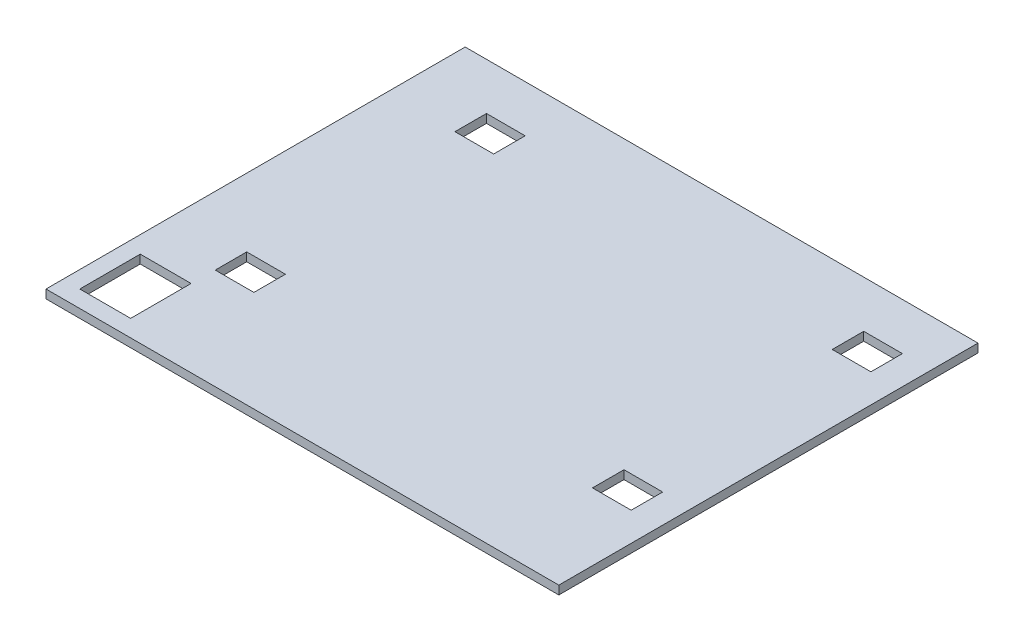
ISO-10303-21;
HEADER;
FILE_DESCRIPTION(('STEP AP214'),'2;1');
FILE_NAME('part.step','',(''),(''),'','','');
FILE_SCHEMA(('AUTOMOTIVE_DESIGN { 1 0 10303 214 1 1 1 1 }'));
ENDSEC;
DATA;
#1=APPLICATION_CONTEXT('core data for automotive mechanical design processes');
#2=APPLICATION_PROTOCOL_DEFINITION('international standard','automotive_design',2000,#1);
#3=PRODUCT_CONTEXT('',#1,'mechanical');
#4=PRODUCT('Part','Part','',(#3));
#5=PRODUCT_RELATED_PRODUCT_CATEGORY('part','',(#4));
#6=PRODUCT_DEFINITION_FORMATION('','',#4);
#7=PRODUCT_DEFINITION_CONTEXT('part definition',#1,'design');
#8=PRODUCT_DEFINITION('design','',#6,#7);
#9=PRODUCT_DEFINITION_SHAPE('','',#8);
#10=(LENGTH_UNIT() NAMED_UNIT(*) SI_UNIT(.MILLI.,.METRE.));
#11=(NAMED_UNIT(*) PLANE_ANGLE_UNIT() SI_UNIT($,.RADIAN.));
#12=(NAMED_UNIT(*) SI_UNIT($,.STERADIAN.) SOLID_ANGLE_UNIT());
#13=UNCERTAINTY_MEASURE_WITH_UNIT(LENGTH_MEASURE(1.E-05),#10,'distance_accuracy_value','');
#14=(GEOMETRIC_REPRESENTATION_CONTEXT(3) GLOBAL_UNCERTAINTY_ASSIGNED_CONTEXT((#13)) GLOBAL_UNIT_ASSIGNED_CONTEXT((#10,
#11,#12)) REPRESENTATION_CONTEXT('',''));
#15=CARTESIAN_POINT('',(0.,0.,0.));
#16=DIRECTION('',(0.,0.,1.));
#17=DIRECTION('',(1.,0.,0.));
#18=AXIS2_PLACEMENT_3D('',#15,#16,#17);
#19=CARTESIAN_POINT('',(175.,6.35,175.));
#20=DIRECTION('',(0.,0.,-1.));
#21=DIRECTION('',(-1.,0.,0.));
#22=AXIS2_PLACEMENT_3D('',#19,#20,#21);
#23=PLANE('',#22);
#24=DIRECTION('',(1.,0.,0.));
#25=VECTOR('',#24,1.);
#26=CARTESIAN_POINT('',(175.,0.,175.));
#27=LINE('',#26,#25);
#28=CARTESIAN_POINT('',(-204.25,0.,175.));
#29=VERTEX_POINT('',#28);
#30=CARTESIAN_POINT('',(175.,0.,175.));
#31=VERTEX_POINT('',#30);
#32=EDGE_CURVE('E340',#29,#31,#27,.T.);
#33=ORIENTED_EDGE('',*,*,#32,.T.);
#34=DIRECTION('',(0.,-1.,0.));
#35=VECTOR('',#34,1.);
#36=CARTESIAN_POINT('',(175.,6.35,175.));
#37=LINE('',#36,#35);
#38=CARTESIAN_POINT('',(175.,6.35,175.));
#39=VERTEX_POINT('',#38);
#40=EDGE_CURVE('E356',#39,#31,#37,.T.);
#41=ORIENTED_EDGE('',*,*,#40,.F.);
#42=DIRECTION('',(1.,0.,0.));
#43=VECTOR('',#42,1.);
#44=CARTESIAN_POINT('',(175.,6.35,175.));
#45=LINE('',#44,#43);
#46=CARTESIAN_POINT('',(-204.25,6.35,175.));
#47=VERTEX_POINT('',#46);
#48=EDGE_CURVE('E350',#47,#39,#45,.T.);
#49=ORIENTED_EDGE('',*,*,#48,.F.);
#50=DIRECTION('',(0.,1.,0.));
#51=VECTOR('',#50,1.);
#52=CARTESIAN_POINT('',(-204.25,-351.220105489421,175.));
#53=LINE('',#52,#51);
#54=EDGE_CURVE('E224',#29,#47,#53,.T.);
#55=ORIENTED_EDGE('',*,*,#54,.F.);
#56=EDGE_LOOP('',(#33,#41,#49,#55));
#57=FACE_BOUND('',#56,.T.);
#58=ADVANCED_FACE('F44',(#57),#23,.F.);
#59=CARTESIAN_POINT('',(175.,6.35,175.));
#60=DIRECTION('',(-1.,0.,0.));
#61=DIRECTION('',(0.,0.,1.));
#62=AXIS2_PLACEMENT_3D('',#59,#60,#61);
#63=PLANE('',#62);
#64=DIRECTION('',(0.,0.,-1.));
#65=VECTOR('',#64,1.);
#66=CARTESIAN_POINT('',(175.,0.,175.));
#67=LINE('',#66,#65);
#68=CARTESIAN_POINT('',(175.,0.,-135.));
#69=VERTEX_POINT('',#68);
#70=EDGE_CURVE('E353',#31,#69,#67,.T.);
#71=ORIENTED_EDGE('',*,*,#70,.T.);
#72=DIRECTION('',(0.,1.,0.));
#73=VECTOR('',#72,1.);
#74=CARTESIAN_POINT('',(175.,-3.65,-135.));
#75=LINE('',#74,#73);
#76=CARTESIAN_POINT('',(175.,6.35,-135.));
#77=VERTEX_POINT('',#76);
#78=EDGE_CURVE('E219',#69,#77,#75,.T.);
#79=ORIENTED_EDGE('',*,*,#78,.T.);
#80=DIRECTION('',(0.,0.,-1.));
#81=VECTOR('',#80,1.);
#82=CARTESIAN_POINT('',(175.,6.35,175.));
#83=LINE('',#82,#81);
#84=EDGE_CURVE('E217',#39,#77,#83,.T.);
#85=ORIENTED_EDGE('',*,*,#84,.F.);
#86=ORIENTED_EDGE('',*,*,#40,.T.);
#87=EDGE_LOOP('',(#71,#79,#85,#86));
#88=FACE_BOUND('',#87,.T.);
#89=ADVANCED_FACE('F492',(#88),#63,.F.);
#90=CARTESIAN_POINT('',(0.,6.35,0.));
#91=DIRECTION('',(0.,1.,0.));
#92=DIRECTION('',(0.,0.,1.));
#93=AXIS2_PLACEMENT_3D('',#90,#91,#92);
#94=PLANE('',#93);
#95=DIRECTION('',(1.,0.,0.));
#96=VECTOR('',#95,1.);
#97=CARTESIAN_POINT('',(-204.25,6.35,-135.));
#98=LINE('',#97,#96);
#99=CARTESIAN_POINT('',(-204.25,6.35,-135.));
#100=VERTEX_POINT('',#99);
#101=EDGE_CURVE('E204',#100,#77,#98,.T.);
#102=ORIENTED_EDGE('',*,*,#101,.F.);
#103=DIRECTION('',(0.,0.,1.));
#104=VECTOR('',#103,1.);
#105=CARTESIAN_POINT('',(-204.25,6.35,175.));
#106=LINE('',#105,#104);
#107=EDGE_CURVE('E214',#100,#47,#106,.T.);
#108=ORIENTED_EDGE('',*,*,#107,.T.);
#109=ORIENTED_EDGE('',*,*,#48,.T.);
#110=ORIENTED_EDGE('',*,*,#84,.T.);
#111=EDGE_LOOP('',(#102,#108,#109,#110));
#112=FACE_BOUND('',#111,.T.);
#113=DIRECTION('',(0.,0.,1.));
#114=VECTOR('',#113,1.);
#115=CARTESIAN_POINT('',(-191.75,6.35,117.8));
#116=LINE('',#115,#114);
#117=CARTESIAN_POINT('',(-191.75,6.35,117.8));
#118=VERTEX_POINT('',#117);
#119=CARTESIAN_POINT('',(-191.75,6.35,162.5));
#120=VERTEX_POINT('',#119);
#121=EDGE_CURVE('E66',#118,#120,#116,.T.);
#122=ORIENTED_EDGE('',*,*,#121,.F.);
#123=DIRECTION('',(1.,0.,0.));
#124=VECTOR('',#123,1.);
#125=CARTESIAN_POINT('',(-191.75,6.35,117.8));
#126=LINE('',#125,#124);
#127=CARTESIAN_POINT('',(-154.15,6.35,117.8));
#128=VERTEX_POINT('',#127);
#129=EDGE_CURVE('E454',#118,#128,#126,.T.);
#130=ORIENTED_EDGE('',*,*,#129,.T.);
#131=DIRECTION('',(0.,0.,1.));
#132=VECTOR('',#131,1.);
#133=CARTESIAN_POINT('',(-154.15,6.35,117.8));
#134=LINE('',#133,#132);
#135=CARTESIAN_POINT('',(-154.15,6.35,162.5));
#136=VERTEX_POINT('',#135);
#137=EDGE_CURVE('E458',#128,#136,#134,.T.);
#138=ORIENTED_EDGE('',*,*,#137,.T.);
#139=DIRECTION('',(1.,0.,0.));
#140=VECTOR('',#139,1.);
#141=CARTESIAN_POINT('',(-191.75,6.35,162.5));
#142=LINE('',#141,#140);
#143=EDGE_CURVE('E463',#120,#136,#142,.T.);
#144=ORIENTED_EDGE('',*,*,#143,.F.);
#145=EDGE_LOOP('',(#122,#130,#138,#144));
#146=FACE_BOUND('',#145,.T.);
#147=DIRECTION('',(0.,0.,1.));
#148=VECTOR('',#147,1.);
#149=CARTESIAN_POINT('',(-153.8,6.35,100.3));
#150=LINE('',#149,#148);
#151=CARTESIAN_POINT('',(-153.8,6.35,77.));
#152=VERTEX_POINT('',#151);
#153=CARTESIAN_POINT('',(-153.8,6.35,100.3));
#154=VERTEX_POINT('',#153);
#155=EDGE_CURVE('E292',#152,#154,#150,.T.);
#156=ORIENTED_EDGE('',*,*,#155,.F.);
#157=DIRECTION('',(-1.,0.,0.));
#158=VECTOR('',#157,1.);
#159=CARTESIAN_POINT('',(-153.8,6.35,77.));
#160=LINE('',#159,#158);
#161=CARTESIAN_POINT('',(-125.2,6.35,77.));
#162=VERTEX_POINT('',#161);
#163=EDGE_CURVE('E270',#162,#152,#160,.T.);
#164=ORIENTED_EDGE('',*,*,#163,.F.);
#165=DIRECTION('',(0.,0.,-1.));
#166=VECTOR('',#165,1.);
#167=CARTESIAN_POINT('',(-125.2,6.35,100.3));
#168=LINE('',#167,#166);
#169=CARTESIAN_POINT('',(-125.2,6.35,100.3));
#170=VERTEX_POINT('',#169);
#171=EDGE_CURVE('E284',#170,#162,#168,.T.);
#172=ORIENTED_EDGE('',*,*,#171,.F.);
#173=DIRECTION('',(1.,0.,0.));
#174=VECTOR('',#173,1.);
#175=CARTESIAN_POINT('',(-153.8,6.35,100.3));
#176=LINE('',#175,#174);
#177=EDGE_CURVE('E288',#154,#170,#176,.T.);
#178=ORIENTED_EDGE('',*,*,#177,.F.);
#179=EDGE_LOOP('',(#156,#164,#172,#178));
#180=FACE_BOUND('',#179,.T.);
#181=DIRECTION('',(0.,0.,1.));
#182=VECTOR('',#181,1.);
#183=CARTESIAN_POINT('',(125.2,6.35,-100.3));
#184=LINE('',#183,#182);
#185=CARTESIAN_POINT('',(125.2,6.35,-100.3));
#186=VERTEX_POINT('',#185);
#187=CARTESIAN_POINT('',(125.2,6.35,-77.));
#188=VERTEX_POINT('',#187);
#189=EDGE_CURVE('E280',#186,#188,#184,.T.);
#190=ORIENTED_EDGE('',*,*,#189,.F.);
#191=DIRECTION('',(-1.,0.,0.));
#192=VECTOR('',#191,1.);
#193=CARTESIAN_POINT('',(153.8,6.35,-100.3));
#194=LINE('',#193,#192);
#195=CARTESIAN_POINT('',(153.8,6.35,-100.3));
#196=VERTEX_POINT('',#195);
#197=EDGE_CURVE('E300',#196,#186,#194,.T.);
#198=ORIENTED_EDGE('',*,*,#197,.F.);
#199=DIRECTION('',(0.,0.,-1.));
#200=VECTOR('',#199,1.);
#201=CARTESIAN_POINT('',(153.8,6.35,-100.3));
#202=LINE('',#201,#200);
#203=CARTESIAN_POINT('',(153.8,6.35,-77.));
#204=VERTEX_POINT('',#203);
#205=EDGE_CURVE('E312',#204,#196,#202,.T.);
#206=ORIENTED_EDGE('',*,*,#205,.F.);
#207=DIRECTION('',(1.,0.,0.));
#208=VECTOR('',#207,1.);
#209=CARTESIAN_POINT('',(153.8,6.35,-77.));
#210=LINE('',#209,#208);
#211=EDGE_CURVE('E316',#188,#204,#210,.T.);
#212=ORIENTED_EDGE('',*,*,#211,.F.);
#213=EDGE_LOOP('',(#190,#198,#206,#212));
#214=FACE_BOUND('',#213,.T.);
#215=DIRECTION('',(1.,0.,0.));
#216=VECTOR('',#215,1.);
#217=CARTESIAN_POINT('',(153.8,6.35,100.3));
#218=LINE('',#217,#216);
#219=CARTESIAN_POINT('',(125.2,6.35,100.3));
#220=VERTEX_POINT('',#219);
#221=CARTESIAN_POINT('',(153.8,6.35,100.3));
#222=VERTEX_POINT('',#221);
#223=EDGE_CURVE('E262',#220,#222,#218,.T.);
#224=ORIENTED_EDGE('',*,*,#223,.F.);
#225=DIRECTION('',(0.,0.,1.));
#226=VECTOR('',#225,1.);
#227=CARTESIAN_POINT('',(125.2,6.35,100.3));
#228=LINE('',#227,#226);
#229=CARTESIAN_POINT('',(125.2,6.35,77.));
#230=VERTEX_POINT('',#229);
#231=EDGE_CURVE('E241',#230,#220,#228,.T.);
#232=ORIENTED_EDGE('',*,*,#231,.F.);
#233=DIRECTION('',(-1.,0.,0.));
#234=VECTOR('',#233,1.);
#235=CARTESIAN_POINT('',(153.8,6.35,77.));
#236=LINE('',#235,#234);
#237=CARTESIAN_POINT('',(153.8,6.35,77.));
#238=VERTEX_POINT('',#237);
#239=EDGE_CURVE('E254',#238,#230,#236,.T.);
#240=ORIENTED_EDGE('',*,*,#239,.F.);
#241=DIRECTION('',(0.,0.,-1.));
#242=VECTOR('',#241,1.);
#243=CARTESIAN_POINT('',(153.8,6.35,100.3));
#244=LINE('',#243,#242);
#245=EDGE_CURVE('E258',#222,#238,#244,.T.);
#246=ORIENTED_EDGE('',*,*,#245,.F.);
#247=EDGE_LOOP('',(#224,#232,#240,#246));
#248=FACE_BOUND('',#247,.T.);
#249=DIRECTION('',(0.,0.,1.));
#250=VECTOR('',#249,1.);
#251=CARTESIAN_POINT('',(-153.8,6.35,-100.3));
#252=LINE('',#251,#250);
#253=CARTESIAN_POINT('',(-153.8,6.35,-100.3));
#254=VERTEX_POINT('',#253);
#255=CARTESIAN_POINT('',(-153.8,6.35,-77.));
#256=VERTEX_POINT('',#255);
#257=EDGE_CURVE('E295',#254,#256,#252,.T.);
#258=ORIENTED_EDGE('',*,*,#257,.F.);
#259=DIRECTION('',(-1.,0.,0.));
#260=VECTOR('',#259,1.);
#261=CARTESIAN_POINT('',(-153.8,6.35,-100.3));
#262=LINE('',#261,#260);
#263=CARTESIAN_POINT('',(-125.2,6.35,-100.3));
#264=VERTEX_POINT('',#263);
#265=EDGE_CURVE('E332',#264,#254,#262,.T.);
#266=ORIENTED_EDGE('',*,*,#265,.F.);
#267=DIRECTION('',(0.,0.,-1.));
#268=VECTOR('',#267,1.);
#269=CARTESIAN_POINT('',(-125.2,6.35,-100.3));
#270=LINE('',#269,#268);
#271=CARTESIAN_POINT('',(-125.2,6.35,-77.));
#272=VERTEX_POINT('',#271);
#273=EDGE_CURVE('E328',#272,#264,#270,.T.);
#274=ORIENTED_EDGE('',*,*,#273,.F.);
#275=DIRECTION('',(1.,0.,0.));
#276=VECTOR('',#275,1.);
#277=CARTESIAN_POINT('',(-153.8,6.35,-77.));
#278=LINE('',#277,#276);
#279=EDGE_CURVE('E324',#256,#272,#278,.T.);
#280=ORIENTED_EDGE('',*,*,#279,.F.);
#281=EDGE_LOOP('',(#258,#266,#274,#280));
#282=FACE_BOUND('',#281,.T.);
#283=ADVANCED_FACE('F212',(#112,#146,#180,#214,#248,#282),#94,.T.);
#284=CARTESIAN_POINT('',(0.,0.,0.));
#285=DIRECTION('',(0.,1.,0.));
#286=DIRECTION('',(0.,0.,1.));
#287=AXIS2_PLACEMENT_3D('',#284,#285,#286);
#288=PLANE('',#287);
#289=DIRECTION('',(1.,0.,0.));
#290=VECTOR('',#289,1.);
#291=CARTESIAN_POINT('',(0.,0.,117.8));
#292=LINE('',#291,#290);
#293=CARTESIAN_POINT('',(-191.75,0.,117.8));
#294=VERTEX_POINT('',#293);
#295=CARTESIAN_POINT('',(-154.15,0.,117.8));
#296=VERTEX_POINT('',#295);
#297=EDGE_CURVE('E437',#294,#296,#292,.T.);
#298=ORIENTED_EDGE('',*,*,#297,.F.);
#299=DIRECTION('',(0.,0.,1.));
#300=VECTOR('',#299,1.);
#301=CARTESIAN_POINT('',(-191.75,0.,0.));
#302=LINE('',#301,#300);
#303=CARTESIAN_POINT('',(-191.75,0.,162.5));
#304=VERTEX_POINT('',#303);
#305=EDGE_CURVE('E52',#294,#304,#302,.T.);
#306=ORIENTED_EDGE('',*,*,#305,.T.);
#307=DIRECTION('',(1.,0.,0.));
#308=VECTOR('',#307,1.);
#309=CARTESIAN_POINT('',(1.1995428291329E-13,0.,162.5));
#310=LINE('',#309,#308);
#311=CARTESIAN_POINT('',(-154.15,0.,162.5));
#312=VERTEX_POINT('',#311);
#313=EDGE_CURVE('E429',#304,#312,#310,.T.);
#314=ORIENTED_EDGE('',*,*,#313,.T.);
#315=DIRECTION('',(0.,0.,1.));
#316=VECTOR('',#315,1.);
#317=CARTESIAN_POINT('',(-154.15,0.,0.));
#318=LINE('',#317,#316);
#319=EDGE_CURVE('E433',#296,#312,#318,.T.);
#320=ORIENTED_EDGE('',*,*,#319,.F.);
#321=EDGE_LOOP('',(#298,#306,#314,#320));
#322=FACE_BOUND('',#321,.T.);
#323=DIRECTION('',(-1.,0.,0.));
#324=VECTOR('',#323,1.);
#325=CARTESIAN_POINT('',(0.,0.,77.));
#326=LINE('',#325,#324);
#327=CARTESIAN_POINT('',(-125.2,0.,77.));
#328=VERTEX_POINT('',#327);
#329=CARTESIAN_POINT('',(-153.8,0.,77.));
#330=VERTEX_POINT('',#329);
#331=EDGE_CURVE('E421',#328,#330,#326,.T.);
#332=ORIENTED_EDGE('',*,*,#331,.T.);
#333=DIRECTION('',(0.,0.,1.));
#334=VECTOR('',#333,1.);
#335=CARTESIAN_POINT('',(-153.8,0.,0.));
#336=LINE('',#335,#334);
#337=CARTESIAN_POINT('',(-153.8,0.,100.3));
#338=VERTEX_POINT('',#337);
#339=EDGE_CURVE('E425',#330,#338,#336,.T.);
#340=ORIENTED_EDGE('',*,*,#339,.T.);
#341=DIRECTION('',(1.,0.,0.));
#342=VECTOR('',#341,1.);
#343=CARTESIAN_POINT('',(0.,0.,100.3));
#344=LINE('',#343,#342);
#345=CARTESIAN_POINT('',(-125.2,0.,100.3));
#346=VERTEX_POINT('',#345);
#347=EDGE_CURVE('E413',#338,#346,#344,.T.);
#348=ORIENTED_EDGE('',*,*,#347,.T.);
#349=DIRECTION('',(0.,0.,-1.));
#350=VECTOR('',#349,1.);
#351=CARTESIAN_POINT('',(-125.2,0.,0.));
#352=LINE('',#351,#350);
#353=EDGE_CURVE('E417',#346,#328,#352,.T.);
#354=ORIENTED_EDGE('',*,*,#353,.T.);
#355=EDGE_LOOP('',(#332,#340,#348,#354));
#356=FACE_BOUND('',#355,.T.);
#357=DIRECTION('',(-1.,0.,0.));
#358=VECTOR('',#357,1.);
#359=CARTESIAN_POINT('',(0.,0.,-100.3));
#360=LINE('',#359,#358);
#361=CARTESIAN_POINT('',(153.8,0.,-100.3));
#362=VERTEX_POINT('',#361);
#363=CARTESIAN_POINT('',(125.2,0.,-100.3));
#364=VERTEX_POINT('',#363);
#365=EDGE_CURVE('E405',#362,#364,#360,.T.);
#366=ORIENTED_EDGE('',*,*,#365,.T.);
#367=DIRECTION('',(0.,0.,1.));
#368=VECTOR('',#367,1.);
#369=CARTESIAN_POINT('',(125.2,0.,0.));
#370=LINE('',#369,#368);
#371=CARTESIAN_POINT('',(125.2,0.,-77.));
#372=VERTEX_POINT('',#371);
#373=EDGE_CURVE('E409',#364,#372,#370,.T.);
#374=ORIENTED_EDGE('',*,*,#373,.T.);
#375=DIRECTION('',(1.,0.,0.));
#376=VECTOR('',#375,1.);
#377=CARTESIAN_POINT('',(0.,0.,-77.));
#378=LINE('',#377,#376);
#379=CARTESIAN_POINT('',(153.8,0.,-77.));
#380=VERTEX_POINT('',#379);
#381=EDGE_CURVE('E397',#372,#380,#378,.T.);
#382=ORIENTED_EDGE('',*,*,#381,.T.);
#383=DIRECTION('',(0.,0.,-1.));
#384=VECTOR('',#383,1.);
#385=CARTESIAN_POINT('',(153.8,0.,0.));
#386=LINE('',#385,#384);
#387=EDGE_CURVE('E401',#380,#362,#386,.T.);
#388=ORIENTED_EDGE('',*,*,#387,.T.);
#389=EDGE_LOOP('',(#366,#374,#382,#388));
#390=FACE_BOUND('',#389,.T.);
#391=DIRECTION('',(0.,0.,1.));
#392=VECTOR('',#391,1.);
#393=CARTESIAN_POINT('',(125.2,0.,0.));
#394=LINE('',#393,#392);
#395=CARTESIAN_POINT('',(125.2,0.,77.));
#396=VERTEX_POINT('',#395);
#397=CARTESIAN_POINT('',(125.2,0.,100.3));
#398=VERTEX_POINT('',#397);
#399=EDGE_CURVE('E389',#396,#398,#394,.T.);
#400=ORIENTED_EDGE('',*,*,#399,.T.);
#401=DIRECTION('',(1.,0.,0.));
#402=VECTOR('',#401,1.);
#403=CARTESIAN_POINT('',(0.,0.,100.3));
#404=LINE('',#403,#402);
#405=CARTESIAN_POINT('',(153.8,0.,100.3));
#406=VERTEX_POINT('',#405);
#407=EDGE_CURVE('E393',#398,#406,#404,.T.);
#408=ORIENTED_EDGE('',*,*,#407,.T.);
#409=DIRECTION('',(0.,0.,-1.));
#410=VECTOR('',#409,1.);
#411=CARTESIAN_POINT('',(153.8,0.,0.));
#412=LINE('',#411,#410);
#413=CARTESIAN_POINT('',(153.8,0.,77.));
#414=VERTEX_POINT('',#413);
#415=EDGE_CURVE('E381',#406,#414,#412,.T.);
#416=ORIENTED_EDGE('',*,*,#415,.T.);
#417=DIRECTION('',(-1.,0.,0.));
#418=VECTOR('',#417,1.);
#419=CARTESIAN_POINT('',(0.,0.,77.));
#420=LINE('',#419,#418);
#421=EDGE_CURVE('E385',#414,#396,#420,.T.);
#422=ORIENTED_EDGE('',*,*,#421,.T.);
#423=EDGE_LOOP('',(#400,#408,#416,#422));
#424=FACE_BOUND('',#423,.T.);
#425=DIRECTION('',(-1.,0.,0.));
#426=VECTOR('',#425,1.);
#427=CARTESIAN_POINT('',(0.,0.,-100.3));
#428=LINE('',#427,#426);
#429=CARTESIAN_POINT('',(-125.2,0.,-100.3));
#430=VERTEX_POINT('',#429);
#431=CARTESIAN_POINT('',(-153.8,0.,-100.3));
#432=VERTEX_POINT('',#431);
#433=EDGE_CURVE('E373',#430,#432,#428,.T.);
#434=ORIENTED_EDGE('',*,*,#433,.T.);
#435=DIRECTION('',(0.,0.,1.));
#436=VECTOR('',#435,1.);
#437=CARTESIAN_POINT('',(-153.8,0.,0.));
#438=LINE('',#437,#436);
#439=CARTESIAN_POINT('',(-153.8,0.,-77.));
#440=VERTEX_POINT('',#439);
#441=EDGE_CURVE('E377',#432,#440,#438,.T.);
#442=ORIENTED_EDGE('',*,*,#441,.T.);
#443=DIRECTION('',(1.,0.,0.));
#444=VECTOR('',#443,1.);
#445=CARTESIAN_POINT('',(0.,0.,-77.));
#446=LINE('',#445,#444);
#447=CARTESIAN_POINT('',(-125.2,0.,-77.));
#448=VERTEX_POINT('',#447);
#449=EDGE_CURVE('E365',#440,#448,#446,.T.);
#450=ORIENTED_EDGE('',*,*,#449,.T.);
#451=DIRECTION('',(0.,0.,-1.));
#452=VECTOR('',#451,1.);
#453=CARTESIAN_POINT('',(-125.2,0.,0.));
#454=LINE('',#453,#452);
#455=EDGE_CURVE('E369',#448,#430,#454,.T.);
#456=ORIENTED_EDGE('',*,*,#455,.T.);
#457=EDGE_LOOP('',(#434,#442,#450,#456));
#458=FACE_BOUND('',#457,.T.);
#459=DIRECTION('',(0.,0.,-1.));
#460=VECTOR('',#459,1.);
#461=CARTESIAN_POINT('',(-204.25,0.,175.));
#462=LINE('',#461,#460);
#463=CARTESIAN_POINT('',(-204.25,0.,-135.));
#464=VERTEX_POINT('',#463);
#465=EDGE_CURVE('E230',#29,#464,#462,.T.);
#466=ORIENTED_EDGE('',*,*,#465,.T.);
#467=DIRECTION('',(1.,0.,0.));
#468=VECTOR('',#467,1.);
#469=CARTESIAN_POINT('',(0.,0.,-135.));
#470=LINE('',#469,#468);
#471=EDGE_CURVE('E58',#464,#69,#470,.T.);
#472=ORIENTED_EDGE('',*,*,#471,.T.);
#473=ORIENTED_EDGE('',*,*,#70,.F.);
#474=ORIENTED_EDGE('',*,*,#32,.F.);
#475=EDGE_LOOP('',(#466,#472,#473,#474));
#476=FACE_BOUND('',#475,.T.);
#477=ADVANCED_FACE('F443',(#322,#356,#390,#424,#458,#476),#288,.F.);
#478=CARTESIAN_POINT('',(-153.8,-3.65,-100.3));
#479=DIRECTION('',(-1.,0.,0.));
#480=DIRECTION('',(0.,0.,1.));
#481=AXIS2_PLACEMENT_3D('',#478,#479,#480);
#482=PLANE('',#481);
#483=DIRECTION('',(0.,1.,0.));
#484=VECTOR('',#483,1.);
#485=CARTESIAN_POINT('',(-153.8,-3.65,-100.3));
#486=LINE('',#485,#484);
#487=EDGE_CURVE('E337',#432,#254,#486,.T.);
#488=ORIENTED_EDGE('',*,*,#487,.T.);
#489=ORIENTED_EDGE('',*,*,#257,.T.);
#490=DIRECTION('',(0.,1.,0.));
#491=VECTOR('',#490,1.);
#492=CARTESIAN_POINT('',(-153.8,-3.65,-77.));
#493=LINE('',#492,#491);
#494=EDGE_CURVE('E336',#440,#256,#493,.T.);
#495=ORIENTED_EDGE('',*,*,#494,.F.);
#496=ORIENTED_EDGE('',*,*,#441,.F.);
#497=EDGE_LOOP('',(#488,#489,#495,#496));
#498=FACE_BOUND('',#497,.T.);
#499=ADVANCED_FACE('F505',(#498),#482,.F.);
#500=CARTESIAN_POINT('',(-153.8,-3.65,-100.3));
#501=DIRECTION('',(0.,0.,-1.));
#502=DIRECTION('',(-1.,0.,0.));
#503=AXIS2_PLACEMENT_3D('',#500,#501,#502);
#504=PLANE('',#503);
#505=DIRECTION('',(0.,1.,0.));
#506=VECTOR('',#505,1.);
#507=CARTESIAN_POINT('',(-125.2,-3.65,-100.3));
#508=LINE('',#507,#506);
#509=EDGE_CURVE('E341',#430,#264,#508,.T.);
#510=ORIENTED_EDGE('',*,*,#509,.T.);
#511=ORIENTED_EDGE('',*,*,#265,.T.);
#512=ORIENTED_EDGE('',*,*,#487,.F.);
#513=ORIENTED_EDGE('',*,*,#433,.F.);
#514=EDGE_LOOP('',(#510,#511,#512,#513));
#515=FACE_BOUND('',#514,.T.);
#516=ADVANCED_FACE('F512',(#515),#504,.F.);
#517=CARTESIAN_POINT('',(-125.2,-3.65,-100.3));
#518=DIRECTION('',(1.,0.,0.));
#519=DIRECTION('',(0.,0.,-1.));
#520=AXIS2_PLACEMENT_3D('',#517,#518,#519);
#521=PLANE('',#520);
#522=DIRECTION('',(0.,1.,0.));
#523=VECTOR('',#522,1.);
#524=CARTESIAN_POINT('',(-125.2,-3.65,-77.));
#525=LINE('',#524,#523);
#526=EDGE_CURVE('E344',#448,#272,#525,.T.);
#527=ORIENTED_EDGE('',*,*,#526,.T.);
#528=ORIENTED_EDGE('',*,*,#273,.T.);
#529=ORIENTED_EDGE('',*,*,#509,.F.);
#530=ORIENTED_EDGE('',*,*,#455,.F.);
#531=EDGE_LOOP('',(#527,#528,#529,#530));
#532=FACE_BOUND('',#531,.T.);
#533=ADVANCED_FACE('F521',(#532),#521,.F.);
#534=CARTESIAN_POINT('',(-153.8,-3.65,-77.));
#535=DIRECTION('',(0.,0.,1.));
#536=DIRECTION('',(1.,0.,0.));
#537=AXIS2_PLACEMENT_3D('',#534,#535,#536);
#538=PLANE('',#537);
#539=ORIENTED_EDGE('',*,*,#494,.T.);
#540=ORIENTED_EDGE('',*,*,#279,.T.);
#541=ORIENTED_EDGE('',*,*,#526,.F.);
#542=ORIENTED_EDGE('',*,*,#449,.F.);
#543=EDGE_LOOP('',(#539,#540,#541,#542));
#544=FACE_BOUND('',#543,.T.);
#545=ADVANCED_FACE('F517',(#544),#538,.F.);
#546=CARTESIAN_POINT('',(153.8,-3.65,100.3));
#547=DIRECTION('',(0.,0.,1.));
#548=DIRECTION('',(1.,0.,0.));
#549=AXIS2_PLACEMENT_3D('',#546,#547,#548);
#550=PLANE('',#549);
#551=DIRECTION('',(0.,1.,0.));
#552=VECTOR('',#551,1.);
#553=CARTESIAN_POINT('',(125.2,-3.65,100.3));
#554=LINE('',#553,#552);
#555=EDGE_CURVE('E248',#398,#220,#554,.T.);
#556=ORIENTED_EDGE('',*,*,#555,.T.);
#557=ORIENTED_EDGE('',*,*,#223,.T.);
#558=DIRECTION('',(0.,1.,0.));
#559=VECTOR('',#558,1.);
#560=CARTESIAN_POINT('',(153.8,-3.65,100.3));
#561=LINE('',#560,#559);
#562=EDGE_CURVE('E237',#406,#222,#561,.T.);
#563=ORIENTED_EDGE('',*,*,#562,.F.);
#564=ORIENTED_EDGE('',*,*,#407,.F.);
#565=EDGE_LOOP('',(#556,#557,#563,#564));
#566=FACE_BOUND('',#565,.T.);
#567=ADVANCED_FACE('F520',(#566),#550,.F.);
#568=CARTESIAN_POINT('',(125.2,-3.65,100.3));
#569=DIRECTION('',(-1.,0.,0.));
#570=DIRECTION('',(0.,0.,1.));
#571=AXIS2_PLACEMENT_3D('',#568,#569,#570);
#572=PLANE('',#571);
#573=DIRECTION('',(0.,1.,0.));
#574=VECTOR('',#573,1.);
#575=CARTESIAN_POINT('',(125.2,-3.65,77.));
#576=LINE('',#575,#574);
#577=EDGE_CURVE('E245',#396,#230,#576,.T.);
#578=ORIENTED_EDGE('',*,*,#577,.T.);
#579=ORIENTED_EDGE('',*,*,#231,.T.);
#580=ORIENTED_EDGE('',*,*,#555,.F.);
#581=ORIENTED_EDGE('',*,*,#399,.F.);
#582=EDGE_LOOP('',(#578,#579,#580,#581));
#583=FACE_BOUND('',#582,.T.);
#584=ADVANCED_FACE('F561',(#583),#572,.F.);
#585=CARTESIAN_POINT('',(153.8,-3.65,77.));
#586=DIRECTION('',(0.,0.,-1.));
#587=DIRECTION('',(-1.,0.,0.));
#588=AXIS2_PLACEMENT_3D('',#585,#586,#587);
#589=PLANE('',#588);
#590=DIRECTION('',(0.,1.,0.));
#591=VECTOR('',#590,1.);
#592=CARTESIAN_POINT('',(153.8,-3.65,77.));
#593=LINE('',#592,#591);
#594=EDGE_CURVE('E242',#414,#238,#593,.T.);
#595=ORIENTED_EDGE('',*,*,#594,.T.);
#596=ORIENTED_EDGE('',*,*,#239,.T.);
#597=ORIENTED_EDGE('',*,*,#577,.F.);
#598=ORIENTED_EDGE('',*,*,#421,.F.);
#599=EDGE_LOOP('',(#595,#596,#597,#598));
#600=FACE_BOUND('',#599,.T.);
#601=ADVANCED_FACE('F564',(#600),#589,.F.);
#602=CARTESIAN_POINT('',(153.8,-3.65,100.3));
#603=DIRECTION('',(1.,0.,0.));
#604=DIRECTION('',(0.,0.,-1.));
#605=AXIS2_PLACEMENT_3D('',#602,#603,#604);
#606=PLANE('',#605);
#607=ORIENTED_EDGE('',*,*,#562,.T.);
#608=ORIENTED_EDGE('',*,*,#245,.T.);
#609=ORIENTED_EDGE('',*,*,#594,.F.);
#610=ORIENTED_EDGE('',*,*,#415,.F.);
#611=EDGE_LOOP('',(#607,#608,#609,#610));
#612=FACE_BOUND('',#611,.T.);
#613=ADVANCED_FACE('F545',(#612),#606,.F.);
#614=CARTESIAN_POINT('',(125.2,-3.65,-100.3));
#615=DIRECTION('',(-1.,0.,0.));
#616=DIRECTION('',(0.,0.,1.));
#617=AXIS2_PLACEMENT_3D('',#614,#615,#616);
#618=PLANE('',#617);
#619=DIRECTION('',(0.,1.,0.));
#620=VECTOR('',#619,1.);
#621=CARTESIAN_POINT('',(125.2,-3.65,-100.3));
#622=LINE('',#621,#620);
#623=EDGE_CURVE('E265',#364,#186,#622,.T.);
#624=ORIENTED_EDGE('',*,*,#623,.T.);
#625=ORIENTED_EDGE('',*,*,#189,.T.);
#626=DIRECTION('',(0.,1.,0.));
#627=VECTOR('',#626,1.);
#628=CARTESIAN_POINT('',(125.2,-3.65,-77.));
#629=LINE('',#628,#627);
#630=EDGE_CURVE('E296',#372,#188,#629,.T.);
#631=ORIENTED_EDGE('',*,*,#630,.F.);
#632=ORIENTED_EDGE('',*,*,#373,.F.);
#633=EDGE_LOOP('',(#624,#625,#631,#632));
#634=FACE_BOUND('',#633,.T.);
#635=ADVANCED_FACE('F533',(#634),#618,.F.);
#636=CARTESIAN_POINT('',(153.8,-3.65,-100.3));
#637=DIRECTION('',(0.,0.,-1.));
#638=DIRECTION('',(-1.,0.,0.));
#639=AXIS2_PLACEMENT_3D('',#636,#637,#638);
#640=PLANE('',#639);
#641=DIRECTION('',(0.,1.,0.));
#642=VECTOR('',#641,1.);
#643=CARTESIAN_POINT('',(153.8,-3.65,-100.3));
#644=LINE('',#643,#642);
#645=EDGE_CURVE('E304',#362,#196,#644,.T.);
#646=ORIENTED_EDGE('',*,*,#645,.T.);
#647=ORIENTED_EDGE('',*,*,#197,.T.);
#648=ORIENTED_EDGE('',*,*,#623,.F.);
#649=ORIENTED_EDGE('',*,*,#365,.F.);
#650=EDGE_LOOP('',(#646,#647,#648,#649));
#651=FACE_BOUND('',#650,.T.);
#652=ADVANCED_FACE('F529',(#651),#640,.F.);
#653=CARTESIAN_POINT('',(153.8,-3.65,-100.3));
#654=DIRECTION('',(1.,0.,0.));
#655=DIRECTION('',(0.,0.,-1.));
#656=AXIS2_PLACEMENT_3D('',#653,#654,#655);
#657=PLANE('',#656);
#658=DIRECTION('',(0.,1.,0.));
#659=VECTOR('',#658,1.);
#660=CARTESIAN_POINT('',(153.8,-3.65,-77.));
#661=LINE('',#660,#659);
#662=EDGE_CURVE('E301',#380,#204,#661,.T.);
#663=ORIENTED_EDGE('',*,*,#662,.T.);
#664=ORIENTED_EDGE('',*,*,#205,.T.);
#665=ORIENTED_EDGE('',*,*,#645,.F.);
#666=ORIENTED_EDGE('',*,*,#387,.F.);
#667=EDGE_LOOP('',(#663,#664,#665,#666));
#668=FACE_BOUND('',#667,.T.);
#669=ADVANCED_FACE('F532',(#668),#657,.F.);
#670=CARTESIAN_POINT('',(153.8,-3.65,-77.));
#671=DIRECTION('',(0.,0.,1.));
#672=DIRECTION('',(1.,0.,0.));
#673=AXIS2_PLACEMENT_3D('',#670,#671,#672);
#674=PLANE('',#673);
#675=ORIENTED_EDGE('',*,*,#630,.T.);
#676=ORIENTED_EDGE('',*,*,#211,.T.);
#677=ORIENTED_EDGE('',*,*,#662,.F.);
#678=ORIENTED_EDGE('',*,*,#381,.F.);
#679=EDGE_LOOP('',(#675,#676,#677,#678));
#680=FACE_BOUND('',#679,.T.);
#681=ADVANCED_FACE('F537',(#680),#674,.F.);
#682=CARTESIAN_POINT('',(-153.8,-3.65,100.3));
#683=DIRECTION('',(-1.,0.,0.));
#684=DIRECTION('',(0.,0.,1.));
#685=AXIS2_PLACEMENT_3D('',#682,#683,#684);
#686=PLANE('',#685);
#687=DIRECTION('',(0.,1.,0.));
#688=VECTOR('',#687,1.);
#689=CARTESIAN_POINT('',(-153.8,-3.65,77.));
#690=LINE('',#689,#688);
#691=EDGE_CURVE('E277',#330,#152,#690,.T.);
#692=ORIENTED_EDGE('',*,*,#691,.T.);
#693=ORIENTED_EDGE('',*,*,#155,.T.);
#694=DIRECTION('',(0.,1.,0.));
#695=VECTOR('',#694,1.);
#696=CARTESIAN_POINT('',(-153.8,-3.65,100.3));
#697=LINE('',#696,#695);
#698=EDGE_CURVE('E266',#338,#154,#697,.T.);
#699=ORIENTED_EDGE('',*,*,#698,.F.);
#700=ORIENTED_EDGE('',*,*,#339,.F.);
#701=EDGE_LOOP('',(#692,#693,#699,#700));
#702=FACE_BOUND('',#701,.T.);
#703=ADVANCED_FACE('F541',(#702),#686,.F.);
#704=CARTESIAN_POINT('',(-153.8,-3.65,77.));
#705=DIRECTION('',(0.,0.,-1.));
#706=DIRECTION('',(-1.,0.,0.));
#707=AXIS2_PLACEMENT_3D('',#704,#705,#706);
#708=PLANE('',#707);
#709=DIRECTION('',(0.,1.,0.));
#710=VECTOR('',#709,1.);
#711=CARTESIAN_POINT('',(-125.2,-3.65,77.));
#712=LINE('',#711,#710);
#713=EDGE_CURVE('E274',#328,#162,#712,.T.);
#714=ORIENTED_EDGE('',*,*,#713,.T.);
#715=ORIENTED_EDGE('',*,*,#163,.T.);
#716=ORIENTED_EDGE('',*,*,#691,.F.);
#717=ORIENTED_EDGE('',*,*,#331,.F.);
#718=EDGE_LOOP('',(#714,#715,#716,#717));
#719=FACE_BOUND('',#718,.T.);
#720=ADVANCED_FACE('F547',(#719),#708,.F.);
#721=CARTESIAN_POINT('',(-125.2,-3.65,100.3));
#722=DIRECTION('',(1.,0.,0.));
#723=DIRECTION('',(0.,0.,-1.));
#724=AXIS2_PLACEMENT_3D('',#721,#722,#723);
#725=PLANE('',#724);
#726=DIRECTION('',(0.,1.,0.));
#727=VECTOR('',#726,1.);
#728=CARTESIAN_POINT('',(-125.2,-3.65,100.3));
#729=LINE('',#728,#727);
#730=EDGE_CURVE('E271',#346,#170,#729,.T.);
#731=ORIENTED_EDGE('',*,*,#730,.T.);
#732=ORIENTED_EDGE('',*,*,#171,.T.);
#733=ORIENTED_EDGE('',*,*,#713,.F.);
#734=ORIENTED_EDGE('',*,*,#353,.F.);
#735=EDGE_LOOP('',(#731,#732,#733,#734));
#736=FACE_BOUND('',#735,.T.);
#737=ADVANCED_FACE('F550',(#736),#725,.F.);
#738=CARTESIAN_POINT('',(-153.8,-3.65,100.3));
#739=DIRECTION('',(0.,0.,1.));
#740=DIRECTION('',(1.,0.,0.));
#741=AXIS2_PLACEMENT_3D('',#738,#739,#740);
#742=PLANE('',#741);
#743=ORIENTED_EDGE('',*,*,#698,.T.);
#744=ORIENTED_EDGE('',*,*,#177,.T.);
#745=ORIENTED_EDGE('',*,*,#730,.F.);
#746=ORIENTED_EDGE('',*,*,#347,.F.);
#747=EDGE_LOOP('',(#743,#744,#745,#746));
#748=FACE_BOUND('',#747,.T.);
#749=ADVANCED_FACE('F554',(#748),#742,.F.);
#750=CARTESIAN_POINT('',(-204.25,-351.220105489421,175.));
#751=DIRECTION('',(-1.,0.,0.));
#752=DIRECTION('',(0.,0.,1.));
#753=AXIS2_PLACEMENT_3D('',#750,#751,#752);
#754=PLANE('',#753);
#755=DIRECTION('',(0.,1.,0.));
#756=VECTOR('',#755,1.);
#757=CARTESIAN_POINT('',(-204.25,-351.220105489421,-135.));
#758=LINE('',#757,#756);
#759=EDGE_CURVE('E11',#464,#100,#758,.T.);
#760=ORIENTED_EDGE('',*,*,#759,.F.);
#761=ORIENTED_EDGE('',*,*,#465,.F.);
#762=ORIENTED_EDGE('',*,*,#54,.T.);
#763=ORIENTED_EDGE('',*,*,#107,.F.);
#764=EDGE_LOOP('',(#760,#761,#762,#763));
#765=FACE_BOUND('',#764,.T.);
#766=ADVANCED_FACE('F222',(#765),#754,.T.);
#767=CARTESIAN_POINT('',(-191.75,-38.65,117.8));
#768=DIRECTION('',(-1.,0.,0.));
#769=DIRECTION('',(0.,0.,1.));
#770=AXIS2_PLACEMENT_3D('',#767,#768,#769);
#771=PLANE('',#770);
#772=DIRECTION('',(0.,1.,0.));
#773=VECTOR('',#772,1.);
#774=CARTESIAN_POINT('',(-191.75,-38.65,117.8));
#775=LINE('',#774,#773);
#776=EDGE_CURVE('E226',#294,#118,#775,.T.);
#777=ORIENTED_EDGE('',*,*,#776,.T.);
#778=ORIENTED_EDGE('',*,*,#121,.T.);
#779=DIRECTION('',(0.,1.,0.));
#780=VECTOR('',#779,1.);
#781=CARTESIAN_POINT('',(-191.75,-38.65,162.5));
#782=LINE('',#781,#780);
#783=EDGE_CURVE('E449',#304,#120,#782,.T.);
#784=ORIENTED_EDGE('',*,*,#783,.F.);
#785=ORIENTED_EDGE('',*,*,#305,.F.);
#786=EDGE_LOOP('',(#777,#778,#784,#785));
#787=FACE_BOUND('',#786,.T.);
#788=ADVANCED_FACE('F447',(#787),#771,.F.);
#789=CARTESIAN_POINT('',(-191.75,-38.65,117.8));
#790=DIRECTION('',(0.,0.,1.));
#791=DIRECTION('',(1.,0.,0.));
#792=AXIS2_PLACEMENT_3D('',#789,#790,#791);
#793=PLANE('',#792);
#794=ORIENTED_EDGE('',*,*,#297,.T.);
#795=DIRECTION('',(0.,1.,0.));
#796=VECTOR('',#795,1.);
#797=CARTESIAN_POINT('',(-154.15,-38.65,117.8));
#798=LINE('',#797,#796);
#799=EDGE_CURVE('E232',#296,#128,#798,.T.);
#800=ORIENTED_EDGE('',*,*,#799,.T.);
#801=ORIENTED_EDGE('',*,*,#129,.F.);
#802=ORIENTED_EDGE('',*,*,#776,.F.);
#803=EDGE_LOOP('',(#794,#800,#801,#802));
#804=FACE_BOUND('',#803,.T.);
#805=ADVANCED_FACE('F451',(#804),#793,.T.);
#806=CARTESIAN_POINT('',(-154.15,-38.65,117.8));
#807=DIRECTION('',(-1.,0.,0.));
#808=DIRECTION('',(0.,0.,1.));
#809=AXIS2_PLACEMENT_3D('',#806,#807,#808);
#810=PLANE('',#809);
#811=ORIENTED_EDGE('',*,*,#319,.T.);
#812=DIRECTION('',(0.,1.,0.));
#813=VECTOR('',#812,1.);
#814=CARTESIAN_POINT('',(-154.15,-38.65,162.5));
#815=LINE('',#814,#813);
#816=EDGE_CURVE('E476',#312,#136,#815,.T.);
#817=ORIENTED_EDGE('',*,*,#816,.T.);
#818=ORIENTED_EDGE('',*,*,#137,.F.);
#819=ORIENTED_EDGE('',*,*,#799,.F.);
#820=EDGE_LOOP('',(#811,#817,#818,#819));
#821=FACE_BOUND('',#820,.T.);
#822=ADVANCED_FACE('F482',(#821),#810,.T.);
#823=CARTESIAN_POINT('',(-191.75,-38.65,162.5));
#824=DIRECTION('',(0.,0.,1.));
#825=DIRECTION('',(1.,0.,0.));
#826=AXIS2_PLACEMENT_3D('',#823,#824,#825);
#827=PLANE('',#826);
#828=ORIENTED_EDGE('',*,*,#783,.T.);
#829=ORIENTED_EDGE('',*,*,#143,.T.);
#830=ORIENTED_EDGE('',*,*,#816,.F.);
#831=ORIENTED_EDGE('',*,*,#313,.F.);
#832=EDGE_LOOP('',(#828,#829,#830,#831));
#833=FACE_BOUND('',#832,.T.);
#834=ADVANCED_FACE('F480',(#833),#827,.F.);
#835=CARTESIAN_POINT('',(-204.25,-3.65,-135.));
#836=DIRECTION('',(0.,0.,1.));
#837=DIRECTION('',(1.,0.,0.));
#838=AXIS2_PLACEMENT_3D('',#835,#836,#837);
#839=PLANE('',#838);
#840=ORIENTED_EDGE('',*,*,#759,.T.);
#841=ORIENTED_EDGE('',*,*,#101,.T.);
#842=ORIENTED_EDGE('',*,*,#78,.F.);
#843=ORIENTED_EDGE('',*,*,#471,.F.);
#844=EDGE_LOOP('',(#840,#841,#842,#843));
#845=FACE_BOUND('',#844,.T.);
#846=ADVANCED_FACE('F203',(#845),#839,.F.);
#847=CLOSED_SHELL('',(#58,#89,#283,#477,#499,#516,#533,#545,#567,#584,#601,#613,#635,#652,#669,
#681,#703,#720,#737,#749,#766,#788,#805,#822,#834,#846));
#848=MANIFOLD_SOLID_BREP('B2',#847);
#849=ADVANCED_BREP_SHAPE_REPRESENTATION('',(#18,#848),#14);
#850=SHAPE_DEFINITION_REPRESENTATION(#9,#849);
ENDSEC;
END-ISO-10303-21;
